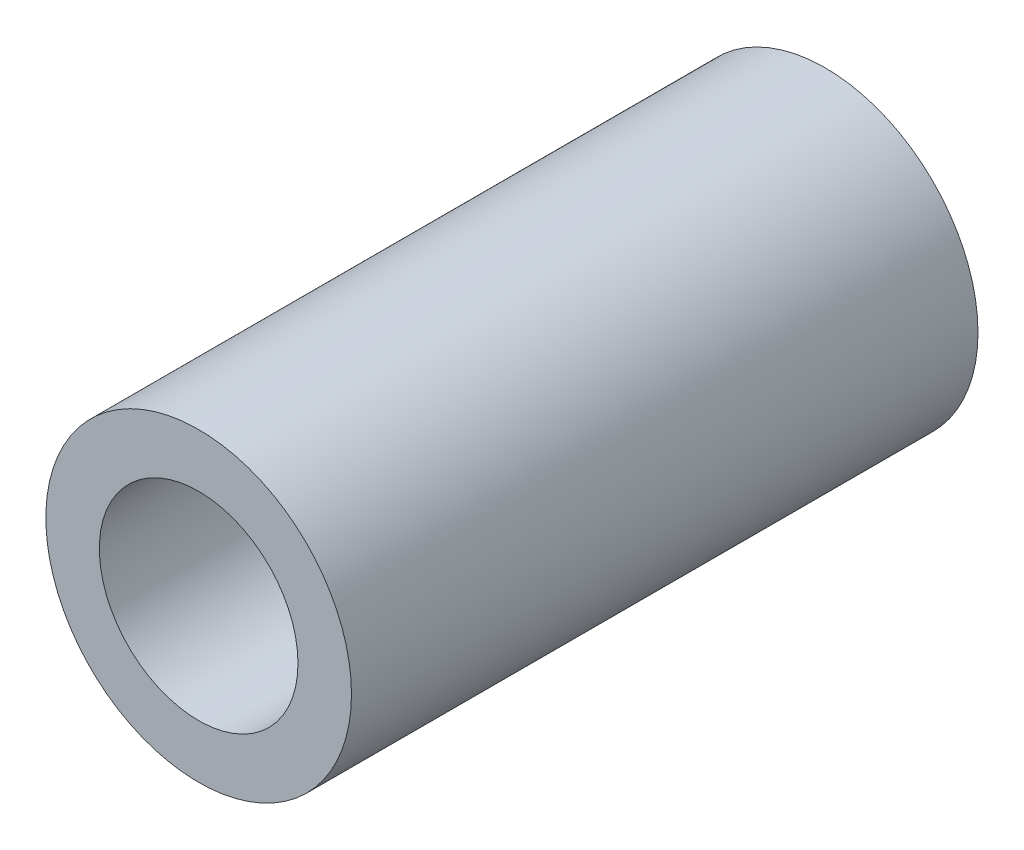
ISO-10303-21;
HEADER;
FILE_DESCRIPTION(('STEP AP214'),'2;1');
FILE_NAME('part.step','',(''),(''),'','','');
FILE_SCHEMA(('AUTOMOTIVE_DESIGN { 1 0 10303 214 1 1 1 1 }'));
ENDSEC;
DATA;
#1=APPLICATION_CONTEXT('core data for automotive mechanical design processes');
#2=APPLICATION_PROTOCOL_DEFINITION('international standard','automotive_design',2000,#1);
#3=PRODUCT_CONTEXT('',#1,'mechanical');
#4=PRODUCT('Part','Part','',(#3));
#5=PRODUCT_RELATED_PRODUCT_CATEGORY('part','',(#4));
#6=PRODUCT_DEFINITION_FORMATION('','',#4);
#7=PRODUCT_DEFINITION_CONTEXT('part definition',#1,'design');
#8=PRODUCT_DEFINITION('design','',#6,#7);
#9=PRODUCT_DEFINITION_SHAPE('','',#8);
#10=(LENGTH_UNIT() NAMED_UNIT(*) SI_UNIT(.MILLI.,.METRE.));
#11=(NAMED_UNIT(*) PLANE_ANGLE_UNIT() SI_UNIT($,.RADIAN.));
#12=(NAMED_UNIT(*) SI_UNIT($,.STERADIAN.) SOLID_ANGLE_UNIT());
#13=UNCERTAINTY_MEASURE_WITH_UNIT(LENGTH_MEASURE(1.E-05),#10,'distance_accuracy_value','');
#14=(GEOMETRIC_REPRESENTATION_CONTEXT(3) GLOBAL_UNCERTAINTY_ASSIGNED_CONTEXT((#13)) GLOBAL_UNIT_ASSIGNED_CONTEXT((#10,
#11,#12)) REPRESENTATION_CONTEXT('',''));
#15=CARTESIAN_POINT('',(0.,0.,0.));
#16=DIRECTION('',(0.,0.,1.));
#17=DIRECTION('',(1.,0.,0.));
#18=AXIS2_PLACEMENT_3D('',#15,#16,#17);
#19=CARTESIAN_POINT('',(0.,0.,20.5));
#20=DIRECTION('',(0.,0.,1.));
#21=DIRECTION('',(1.,0.,0.));
#22=AXIS2_PLACEMENT_3D('',#19,#20,#21);
#23=PLANE('',#22);
#24=CARTESIAN_POINT('',(0.,0.,20.5));
#25=DIRECTION('',(0.,0.,1.));
#26=DIRECTION('',(1.,0.,0.));
#27=AXIS2_PLACEMENT_3D('',#24,#25,#26);
#28=CIRCLE('',#27,5.);
#29=CARTESIAN_POINT('',(5.,0.,20.5));
#30=VERTEX_POINT('',#29);
#31=EDGE_CURVE('E10',#30,#30,#28,.T.);
#32=ORIENTED_EDGE('',*,*,#31,.T.);
#33=EDGE_LOOP('',(#32));
#34=FACE_BOUND('',#33,.T.);
#35=CARTESIAN_POINT('',(0.,0.,20.5));
#36=DIRECTION('',(0.,0.,1.));
#37=DIRECTION('',(1.,0.,0.));
#38=AXIS2_PLACEMENT_3D('',#35,#36,#37);
#39=CIRCLE('',#38,3.25);
#40=CARTESIAN_POINT('',(3.25,0.,20.5));
#41=VERTEX_POINT('',#40);
#42=EDGE_CURVE('E40',#41,#41,#39,.T.);
#43=ORIENTED_EDGE('',*,*,#42,.F.);
#44=EDGE_LOOP('',(#43));
#45=FACE_BOUND('',#44,.T.);
#46=ADVANCED_FACE('F29',(#34,#45),#23,.T.);
#47=CARTESIAN_POINT('',(0.,0.,0.));
#48=DIRECTION('',(0.,0.,1.));
#49=DIRECTION('',(1.,0.,0.));
#50=AXIS2_PLACEMENT_3D('',#47,#48,#49);
#51=PLANE('',#50);
#52=CARTESIAN_POINT('',(0.,0.,0.));
#53=DIRECTION('',(0.,0.,1.));
#54=DIRECTION('',(1.,0.,0.));
#55=AXIS2_PLACEMENT_3D('',#52,#53,#54);
#56=CIRCLE('',#55,5.);
#57=CARTESIAN_POINT('',(5.,0.,0.));
#58=VERTEX_POINT('',#57);
#59=EDGE_CURVE('E33',#58,#58,#56,.T.);
#60=ORIENTED_EDGE('',*,*,#59,.F.);
#61=EDGE_LOOP('',(#60));
#62=FACE_BOUND('',#61,.T.);
#63=CARTESIAN_POINT('',(0.,0.,0.));
#64=DIRECTION('',(0.,0.,1.));
#65=DIRECTION('',(1.,0.,0.));
#66=AXIS2_PLACEMENT_3D('',#63,#64,#65);
#67=CIRCLE('',#66,3.25);
#68=CARTESIAN_POINT('',(3.25,0.,0.));
#69=VERTEX_POINT('',#68);
#70=EDGE_CURVE('E42',#69,#69,#67,.T.);
#71=ORIENTED_EDGE('',*,*,#70,.T.);
#72=EDGE_LOOP('',(#71));
#73=FACE_BOUND('',#72,.T.);
#74=ADVANCED_FACE('F52',(#62,#73),#51,.F.);
#75=CARTESIAN_POINT('',(0.,0.,20.5));
#76=DIRECTION('',(0.,0.,-1.));
#77=DIRECTION('',(-1.,0.,0.));
#78=AXIS2_PLACEMENT_3D('',#75,#76,#77);
#79=CYLINDRICAL_SURFACE('',#78,5.);
#80=ORIENTED_EDGE('',*,*,#31,.F.);
#81=EDGE_LOOP('',(#80));
#82=FACE_BOUND('',#81,.T.);
#83=ORIENTED_EDGE('',*,*,#59,.T.);
#84=EDGE_LOOP('',(#83));
#85=FACE_BOUND('',#84,.T.);
#86=ADVANCED_FACE('F31',(#82,#85),#79,.T.);
#87=CARTESIAN_POINT('',(0.,0.,20.5));
#88=DIRECTION('',(0.,0.,-1.));
#89=DIRECTION('',(-1.,0.,0.));
#90=AXIS2_PLACEMENT_3D('',#87,#88,#89);
#91=CYLINDRICAL_SURFACE('',#90,3.25);
#92=ORIENTED_EDGE('',*,*,#42,.T.);
#93=EDGE_LOOP('',(#92));
#94=FACE_BOUND('',#93,.T.);
#95=ORIENTED_EDGE('',*,*,#70,.F.);
#96=EDGE_LOOP('',(#95));
#97=FACE_BOUND('',#96,.T.);
#98=ADVANCED_FACE('F48',(#94,#97),#91,.F.);
#99=CLOSED_SHELL('',(#46,#74,#86,#98));
#100=MANIFOLD_SOLID_BREP('B2',#99);
#101=ADVANCED_BREP_SHAPE_REPRESENTATION('',(#18,#100),#14);
#102=SHAPE_DEFINITION_REPRESENTATION(#9,#101);
ENDSEC;
END-ISO-10303-21;
